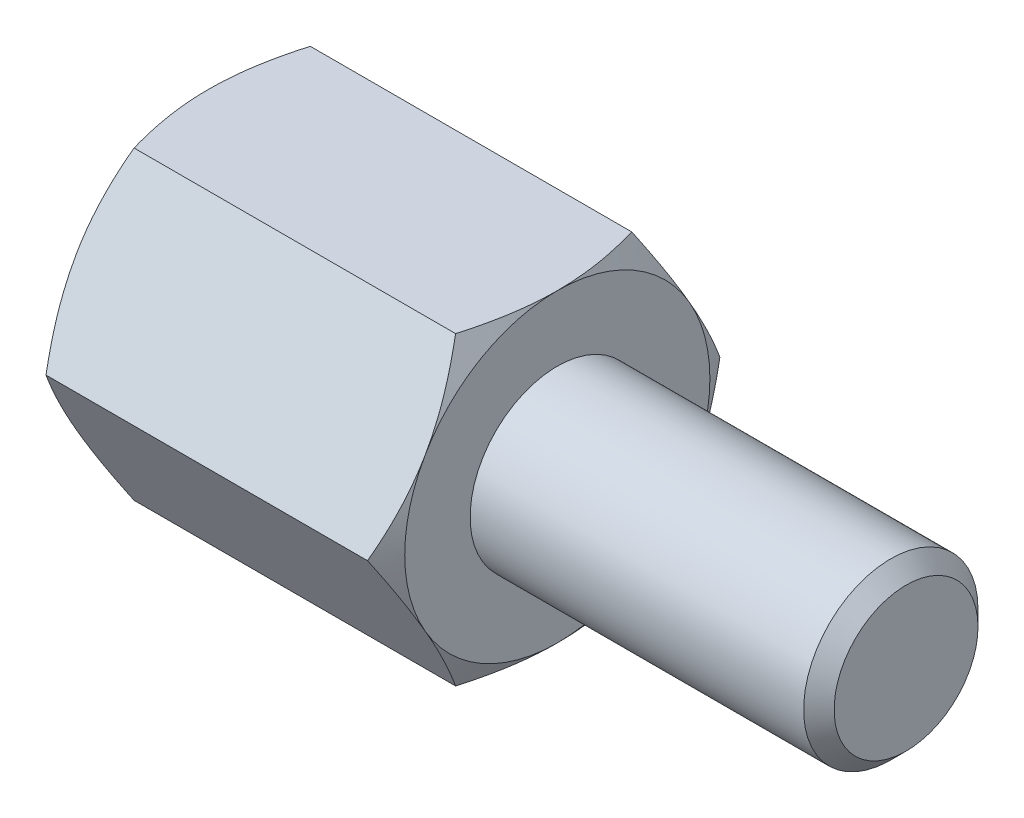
ISO-10303-21;
HEADER;
FILE_DESCRIPTION(('STEP AP214'),'2;1');
FILE_NAME('part.step','',(''),(''),'','','');
FILE_SCHEMA(('AUTOMOTIVE_DESIGN { 1 0 10303 214 1 1 1 1 }'));
ENDSEC;
DATA;
#1=APPLICATION_CONTEXT('core data for automotive mechanical design processes');
#2=APPLICATION_PROTOCOL_DEFINITION('international standard','automotive_design',2000,#1);
#3=PRODUCT_CONTEXT('',#1,'mechanical');
#4=PRODUCT('Part','Part','',(#3));
#5=PRODUCT_RELATED_PRODUCT_CATEGORY('part','',(#4));
#6=PRODUCT_DEFINITION_FORMATION('','',#4);
#7=PRODUCT_DEFINITION_CONTEXT('part definition',#1,'design');
#8=PRODUCT_DEFINITION('design','',#6,#7);
#9=PRODUCT_DEFINITION_SHAPE('','',#8);
#10=(LENGTH_UNIT() NAMED_UNIT(*) SI_UNIT(.MILLI.,.METRE.));
#11=(NAMED_UNIT(*) PLANE_ANGLE_UNIT() SI_UNIT($,.RADIAN.));
#12=(NAMED_UNIT(*) SI_UNIT($,.STERADIAN.) SOLID_ANGLE_UNIT());
#13=UNCERTAINTY_MEASURE_WITH_UNIT(LENGTH_MEASURE(1.E-05),#10,'distance_accuracy_value','');
#14=(GEOMETRIC_REPRESENTATION_CONTEXT(3) GLOBAL_UNCERTAINTY_ASSIGNED_CONTEXT((#13)) GLOBAL_UNIT_ASSIGNED_CONTEXT((#10,
#11,#12)) REPRESENTATION_CONTEXT('',''));
#15=CARTESIAN_POINT('',(0.,0.,0.));
#16=DIRECTION('',(0.,0.,1.));
#17=DIRECTION('',(1.,0.,0.));
#18=AXIS2_PLACEMENT_3D('',#15,#16,#17);
#19=CARTESIAN_POINT('',(4.,3.5,-2.02072594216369));
#20=DIRECTION('',(1.,0.,0.));
#21=DIRECTION('',(0.,0.,-1.));
#22=AXIS2_PLACEMENT_3D('',#19,#20,#21);
#23=PLANE('',#22);
#24=CARTESIAN_POINT('',(4.,0.,0.));
#25=DIRECTION('',(1.,0.,0.));
#26=DIRECTION('',(0.,0.,-1.));
#27=AXIS2_PLACEMENT_3D('',#24,#25,#26);
#28=CIRCLE('',#27,3.5);
#29=CARTESIAN_POINT('',(4.,-1.75,-3.03108891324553));
#30=VERTEX_POINT('',#29);
#31=CARTESIAN_POINT('',(4.,1.75,-3.03108891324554));
#32=VERTEX_POINT('',#31);
#33=EDGE_CURVE('E288',#30,#32,#28,.T.);
#34=ORIENTED_EDGE('',*,*,#33,.T.);
#35=CARTESIAN_POINT('',(4.,3.5,0.));
#36=VERTEX_POINT('',#35);
#37=EDGE_CURVE('E53',#32,#36,#28,.T.);
#38=ORIENTED_EDGE('',*,*,#37,.T.);
#39=CARTESIAN_POINT('',(4.,1.75,3.03108891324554));
#40=VERTEX_POINT('',#39);
#41=EDGE_CURVE('E295',#36,#40,#28,.T.);
#42=ORIENTED_EDGE('',*,*,#41,.T.);
#43=CARTESIAN_POINT('',(4.,-1.75,3.03108891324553));
#44=VERTEX_POINT('',#43);
#45=EDGE_CURVE('E300',#40,#44,#28,.T.);
#46=ORIENTED_EDGE('',*,*,#45,.T.);
#47=CARTESIAN_POINT('',(4.,0.,0.));
#48=DIRECTION('',(-1.,0.,0.));
#49=DIRECTION('',(0.,-1.,0.));
#50=AXIS2_PLACEMENT_3D('',#47,#48,#49);
#51=CIRCLE('',#50,3.5);
#52=CARTESIAN_POINT('',(4.,-3.5,0.));
#53=VERTEX_POINT('',#52);
#54=EDGE_CURVE('E193',#53,#44,#51,.T.);
#55=ORIENTED_EDGE('',*,*,#54,.F.);
#56=EDGE_CURVE('E61',#53,#30,#28,.T.);
#57=ORIENTED_EDGE('',*,*,#56,.T.);
#58=EDGE_LOOP('',(#34,#38,#42,#46,#55,#57));
#59=FACE_BOUND('',#58,.T.);
#60=CARTESIAN_POINT('',(4.,0.,0.));
#61=DIRECTION('',(1.,0.,0.));
#62=DIRECTION('',(0.,0.,-1.));
#63=AXIS2_PLACEMENT_3D('',#60,#61,#62);
#64=CIRCLE('',#63,2.);
#65=CARTESIAN_POINT('',(4.,0.,-2.));
#66=VERTEX_POINT('',#65);
#67=EDGE_CURVE('E311',#66,#66,#64,.T.);
#68=ORIENTED_EDGE('',*,*,#67,.F.);
#69=EDGE_LOOP('',(#68));
#70=FACE_BOUND('',#69,.T.);
#71=ADVANCED_FACE('F37',(#59,#70),#23,.T.);
#72=CARTESIAN_POINT('',(4.,0.,-4.04145188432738));
#73=DIRECTION('',(0.,-0.5,0.866025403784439));
#74=DIRECTION('',(0.,-0.866025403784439,-0.5));
#75=AXIS2_PLACEMENT_3D('',#72,#73,#74);
#76=PLANE('',#75);
#77=CARTESIAN_POINT('',(3.68732593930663,-0.000200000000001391,-4.04156735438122));
#78=CARTESIAN_POINT('',(3.73861421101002,0.153607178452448,-3.9527667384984));
#79=CARTESIAN_POINT('',(3.78525904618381,0.308742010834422,-3.86319960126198));
#80=CARTESIAN_POINT('',(3.86667812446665,0.621698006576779,-3.68251437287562));
#81=CARTESIAN_POINT('',(3.90142356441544,0.779524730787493,-3.59139307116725));
#82=CARTESIAN_POINT('',(3.95550997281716,1.09322221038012,-3.41027974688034));
#83=CARTESIAN_POINT('',(3.97521091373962,1.24904469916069,-3.32031559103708));
#84=CARTESIAN_POINT('',(3.99872986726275,1.56142288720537,-3.13996396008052));
#85=CARTESIAN_POINT('',(4.00256735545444,1.71797745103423,-3.04957714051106));
#86=CARTESIAN_POINT('',(3.99458469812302,2.01050921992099,-2.88068384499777));
#87=CARTESIAN_POINT('',(3.98472456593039,2.1465302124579,-2.80215208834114));
#88=CARTESIAN_POINT('',(3.9534735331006,2.41768602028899,-2.64560020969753));
#89=CARTESIAN_POINT('',(3.9320719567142,2.55281989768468,-2.5675806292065));
#90=CARTESIAN_POINT('',(3.87856959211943,2.82453479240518,-2.41070596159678));
#91=CARTESIAN_POINT('',(3.84624200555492,2.96108141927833,-2.33187072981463));
#92=CARTESIAN_POINT('',(3.77287106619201,3.2321380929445,-2.17537608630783));
#93=CARTESIAN_POINT('',(3.73184495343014,3.36665161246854,-2.09771466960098));
#94=CARTESIAN_POINT('',(3.68732593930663,3.5002,-2.02061047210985));
#95=B_SPLINE_CURVE_WITH_KNOTS('',3,(#77,#78,#79,#80,#81,#82,#83,#84,#85,#86,#87,#88,#89,#90,#91,
#92,#93,#94),.UNSPECIFIED.,.F.,.F.,(4,2,2,2,2,2,2,2,4),(0.,0.554793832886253,1.11092123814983,
1.65328467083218,2.19498204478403,2.6666513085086,3.13875761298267,3.62133612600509,
4.10296698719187),.UNSPECIFIED.);
#96=CARTESIAN_POINT('',(3.68739260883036,0.,-4.04145188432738));
#97=VERTEX_POINT('',#96);
#98=EDGE_CURVE('E310',#97,#32,#95,.T.);
#99=ORIENTED_EDGE('',*,*,#98,.F.);
#100=DIRECTION('',(-1.,0.,0.));
#101=VECTOR('',#100,1.);
#102=CARTESIAN_POINT('',(4.,0.,-4.04145188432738));
#103=LINE('',#102,#101);
#104=CARTESIAN_POINT('',(-3.68739260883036,0.,-4.04145188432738));
#105=VERTEX_POINT('',#104);
#106=EDGE_CURVE('E264',#97,#105,#103,.T.);
#107=ORIENTED_EDGE('',*,*,#106,.T.);
#108=CARTESIAN_POINT('',(-3.68732593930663,3.5002,-2.02061047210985));
#109=CARTESIAN_POINT('',(-3.73861421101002,3.34639282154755,-2.10941108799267));
#110=CARTESIAN_POINT('',(-3.78525904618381,3.19125798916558,-2.19897822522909));
#111=CARTESIAN_POINT('',(-3.86667812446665,2.87830199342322,-2.37966345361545));
#112=CARTESIAN_POINT('',(-3.90142356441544,2.7204752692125,-2.47078475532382));
#113=CARTESIAN_POINT('',(-3.95550997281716,2.40677778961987,-2.65189807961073));
#114=CARTESIAN_POINT('',(-3.97521091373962,2.25095530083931,-2.74186223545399));
#115=CARTESIAN_POINT('',(-3.99872986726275,1.93857711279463,-2.92221386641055));
#116=CARTESIAN_POINT('',(-4.00256735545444,1.78202254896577,-3.01260068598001));
#117=CARTESIAN_POINT('',(-3.99458469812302,1.48949078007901,-3.18149398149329));
#118=CARTESIAN_POINT('',(-3.98472456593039,1.3534697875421,-3.26002573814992));
#119=CARTESIAN_POINT('',(-3.9534735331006,1.08231397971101,-3.41657761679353));
#120=CARTESIAN_POINT('',(-3.9320719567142,0.947180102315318,-3.49459719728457));
#121=CARTESIAN_POINT('',(-3.87856959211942,0.675465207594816,-3.65147186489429));
#122=CARTESIAN_POINT('',(-3.84624200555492,0.538918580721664,-3.73030709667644));
#123=CARTESIAN_POINT('',(-3.77287106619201,0.267861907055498,-3.88680174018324));
#124=CARTESIAN_POINT('',(-3.73184495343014,0.133348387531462,-3.96446315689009));
#125=CARTESIAN_POINT('',(-3.68732593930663,-0.000200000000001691,-4.04156735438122));
#126=B_SPLINE_CURVE_WITH_KNOTS('',3,(#108,#109,#110,#111,#112,#113,#114,#115,#116,#117,#118,
#119,#120,#121,#122,#123,#124,#125),.UNSPECIFIED.,.F.,.F.,(4,2,2,2,2,2,2,2,4),(0.,
0.554793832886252,1.11092123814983,1.65328467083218,2.19498204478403,2.6666513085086,
3.13875761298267,3.6213361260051,4.10296698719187),.UNSPECIFIED.);
#127=CARTESIAN_POINT('',(-4.,1.75,-3.03108891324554));
#128=VERTEX_POINT('',#127);
#129=EDGE_CURVE('E376',#128,#105,#126,.T.);
#130=ORIENTED_EDGE('',*,*,#129,.F.);
#131=CARTESIAN_POINT('',(-3.68739260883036,3.5,-2.02072594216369));
#132=VERTEX_POINT('',#131);
#133=EDGE_CURVE('E378',#132,#128,#126,.T.);
#134=ORIENTED_EDGE('',*,*,#133,.F.);
#135=DIRECTION('',(-1.,0.,0.));
#136=VECTOR('',#135,1.);
#137=CARTESIAN_POINT('',(4.,3.5,-2.02072594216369));
#138=LINE('',#137,#136);
#139=CARTESIAN_POINT('',(3.68739260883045,3.5,-2.02072594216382));
#140=VERTEX_POINT('',#139);
#141=EDGE_CURVE('E279',#140,#132,#138,.T.);
#142=ORIENTED_EDGE('',*,*,#141,.F.);
#143=EDGE_CURVE('E229',#32,#140,#95,.T.);
#144=ORIENTED_EDGE('',*,*,#143,.F.);
#145=EDGE_LOOP('',(#99,#107,#130,#134,#142,#144));
#146=FACE_BOUND('',#145,.T.);
#147=ADVANCED_FACE('F148',(#146),#76,.F.);
#148=CARTESIAN_POINT('',(4.,3.5,-2.02072594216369));
#149=DIRECTION('',(0.,-1.,0.));
#150=DIRECTION('',(0.,0.,-1.));
#151=AXIS2_PLACEMENT_3D('',#148,#149,#150);
#152=PLANE('',#151);
#153=CARTESIAN_POINT('',(2.24432944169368,3.5,-5.52571367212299));
#154=CARTESIAN_POINT('',(2.3192813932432,3.5,-5.37200190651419));
#155=CARTESIAN_POINT('',(2.39354243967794,3.5,-5.21794762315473));
#156=CARTESIAN_POINT('',(2.54029601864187,3.5,-4.90897223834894));
#157=CARTESIAN_POINT('',(2.61278829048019,3.5,-4.75405101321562));
#158=CARTESIAN_POINT('',(2.75596172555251,3.5,-4.44240758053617));
#159=CARTESIAN_POINT('',(2.82663168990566,3.5,-4.28568021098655));
#160=CARTESIAN_POINT('',(2.96520746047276,3.5,-3.97101270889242));
#161=CARTESIAN_POINT('',(3.03311339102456,3.5,-3.81307263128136));
#162=CARTESIAN_POINT('',(3.16771439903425,3.5,-3.49026114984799));
#163=CARTESIAN_POINT('',(3.23428710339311,3.5,-3.32533845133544));
#164=CARTESIAN_POINT('',(3.36262677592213,3.5,-2.99359992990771));
#165=CARTESIAN_POINT('',(3.42439321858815,3.5,-2.82678390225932));
#166=CARTESIAN_POINT('',(3.54157006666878,3.5,-2.49127529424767));
#167=CARTESIAN_POINT('',(3.59699254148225,3.5,-2.32258697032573));
#168=CARTESIAN_POINT('',(3.69976794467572,3.5,-1.98279215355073));
#169=CARTESIAN_POINT('',(3.74712331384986,3.5,-1.81168640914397));
#170=CARTESIAN_POINT('',(3.83129873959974,3.5,-1.46793354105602));
#171=CARTESIAN_POINT('',(3.86817965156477,3.5,-1.2953015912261));
#172=CARTESIAN_POINT('',(3.92939557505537,3.5,-0.947791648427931));
#173=CARTESIAN_POINT('',(3.953731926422,3.5,-0.77291389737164));
#174=CARTESIAN_POINT('',(3.9876038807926,3.5,-0.424108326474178));
#175=CARTESIAN_POINT('',(3.99733725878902,3.5,-0.250200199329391));
#176=CARTESIAN_POINT('',(4.00170533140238,3.5,0.0978233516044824));
#177=CARTESIAN_POINT('',(3.99633996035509,3.5,0.27193877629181));
#178=CARTESIAN_POINT('',(3.97501181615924,3.5,0.564711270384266));
#179=CARTESIAN_POINT('',(3.96289198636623,3.5,0.683667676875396));
#180=CARTESIAN_POINT('',(3.93230809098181,3.5,0.920767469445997));
#181=CARTESIAN_POINT('',(3.91384324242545,3.5,1.03891075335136));
#182=CARTESIAN_POINT('',(3.84989562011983,3.5,1.39193174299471));
#183=CARTESIAN_POINT('',(3.79586958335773,3.5,1.62528232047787));
#184=CARTESIAN_POINT('',(3.70145152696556,3.5,1.97433825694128));
#185=CARTESIAN_POINT('',(3.66729009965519,3.5,2.09183268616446));
#186=CARTESIAN_POINT('',(3.59523444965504,3.5,2.32568238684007));
#187=CARTESIAN_POINT('',(3.55734019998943,3.5,2.44203765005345));
#188=CARTESIAN_POINT('',(3.47844216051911,3.5,2.67364238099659));
#189=CARTESIAN_POINT('',(3.43743925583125,3.5,2.78889215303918));
#190=CARTESIAN_POINT('',(3.35282457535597,3.5,3.01842460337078));
#191=CARTESIAN_POINT('',(3.30921284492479,3.5,3.13270729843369));
#192=CARTESIAN_POINT('',(3.19582414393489,3.5,3.42150510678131));
#193=CARTESIAN_POINT('',(3.12456360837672,3.5,3.59543696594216));
#194=CARTESIAN_POINT('',(2.97810267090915,3.5,3.94163961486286));
#195=CARTESIAN_POINT('',(2.90290192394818,3.5,4.11391025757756));
#196=CARTESIAN_POINT('',(2.74942525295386,3.5,4.45713072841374));
#197=CARTESIAN_POINT('',(2.67114846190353,3.5,4.62808016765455));
#198=CARTESIAN_POINT('',(2.51218826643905,3.5,4.9688584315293));
#199=CARTESIAN_POINT('',(2.43150479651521,3.5,5.13868722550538));
#200=CARTESIAN_POINT('',(2.18638713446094,3.5,5.64726192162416));
#201=CARTESIAN_POINT('',(2.0190975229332,3.5,5.98463020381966));
#202=CARTESIAN_POINT('',(1.67958549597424,3.5,6.65678495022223));
#203=CARTESIAN_POINT('',(1.50736391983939,3.5,6.99157184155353));
#204=CARTESIAN_POINT('',(1.17608002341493,3.5,7.62749570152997));
#205=CARTESIAN_POINT('',(1.01732992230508,3.5,7.92879562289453));
#206=CARTESIAN_POINT('',(0.697747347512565,3.5,8.53030635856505));
#207=CARTESIAN_POINT('',(0.536914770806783,3.5,8.83051711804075));
#208=CARTESIAN_POINT('',(0.214179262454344,3.5,9.42918006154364));
#209=CARTESIAN_POINT('',(0.0522810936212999,3.5,9.72763481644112));
#210=CARTESIAN_POINT('',(-0.272726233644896,3.5,10.3238577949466));
#211=CARTESIAN_POINT('',(-0.435835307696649,3.5,10.6216260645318));
#212=CARTESIAN_POINT('',(-0.599389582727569,3.5,10.9191478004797));
#213=B_SPLINE_CURVE_WITH_KNOTS('',3,(#153,#154,#155,#156,#157,#158,#159,#160,#161,#162,#163,
#164,#165,#166,#167,#168,#169,#170,#171,#172,#173,#174,#175,#176,#177,#178,#179,#180,#181,#182,
#183,#184,#185,#186,#187,#188,#189,#190,#191,#192,#193,#194,#195,#196,#197,#198,#199,#200,#201,
#202,#203,#204,#205,#206,#207,#208,#209,#210,#211,#212),.UNSPECIFIED.,.F.,.F.,(4,2,2,2,2,2,2,2,
2,2,2,2,2,2,2,2,2,2,2,2,2,2,2,2,2,2,2,2,2,4),(0.,0.513041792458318,1.02615874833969,
1.54190801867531,2.05763406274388,2.59113284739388,3.1246898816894,3.65721433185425,
4.18957737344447,4.71878103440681,5.24792816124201,5.76984197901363,6.29175806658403,
6.65030258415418,7.0088913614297,7.72642330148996,8.09346920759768,8.46051776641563,
8.8274622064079,9.19440026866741,9.75822236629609,10.3220939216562,10.8861255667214,
11.4501725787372,12.579801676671,13.7092396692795,14.730918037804,15.7526471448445,
16.7712589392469,17.7898004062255),.UNSPECIFIED.);
#214=EDGE_CURVE('E227',#140,#36,#213,.T.);
#215=ORIENTED_EDGE('',*,*,#214,.F.);
#216=ORIENTED_EDGE('',*,*,#141,.T.);
#217=CARTESIAN_POINT('',(-2.24432944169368,3.5,-5.52571367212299));
#218=CARTESIAN_POINT('',(-2.3192813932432,3.5,-5.37200190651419));
#219=CARTESIAN_POINT('',(-2.39354243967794,3.5,-5.21794762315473));
#220=CARTESIAN_POINT('',(-2.54029601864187,3.5,-4.90897223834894));
#221=CARTESIAN_POINT('',(-2.61278829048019,3.5,-4.75405101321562));
#222=CARTESIAN_POINT('',(-2.75596172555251,3.5,-4.44240758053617));
#223=CARTESIAN_POINT('',(-2.82663168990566,3.5,-4.28568021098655));
#224=CARTESIAN_POINT('',(-2.96520746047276,3.5,-3.97101270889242));
#225=CARTESIAN_POINT('',(-3.03311339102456,3.5,-3.81307263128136));
#226=CARTESIAN_POINT('',(-3.16771439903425,3.5,-3.49026114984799));
#227=CARTESIAN_POINT('',(-3.23428710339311,3.5,-3.32533845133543));
#228=CARTESIAN_POINT('',(-3.36262677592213,3.5,-2.99359992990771));
#229=CARTESIAN_POINT('',(-3.42439321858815,3.5,-2.82678390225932));
#230=CARTESIAN_POINT('',(-3.54157006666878,3.5,-2.49127529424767));
#231=CARTESIAN_POINT('',(-3.59699254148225,3.5,-2.32258697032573));
#232=CARTESIAN_POINT('',(-3.69976794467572,3.5,-1.98279215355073));
#233=CARTESIAN_POINT('',(-3.74712331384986,3.5,-1.81168640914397));
#234=CARTESIAN_POINT('',(-3.83129873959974,3.5,-1.46793354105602));
#235=CARTESIAN_POINT('',(-3.86817965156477,3.5,-1.2953015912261));
#236=CARTESIAN_POINT('',(-3.92939557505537,3.5,-0.947791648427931));
#237=CARTESIAN_POINT('',(-3.953731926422,3.5,-0.77291389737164));
#238=CARTESIAN_POINT('',(-3.9876038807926,3.5,-0.424108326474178));
#239=CARTESIAN_POINT('',(-3.99733725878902,3.5,-0.25020019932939));
#240=CARTESIAN_POINT('',(-4.00170533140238,3.5,0.0978233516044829));
#241=CARTESIAN_POINT('',(-3.99633996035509,3.5,0.271938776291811));
#242=CARTESIAN_POINT('',(-3.97501181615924,3.5,0.564711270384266));
#243=CARTESIAN_POINT('',(-3.96289198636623,3.5,0.683667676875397));
#244=CARTESIAN_POINT('',(-3.93230809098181,3.5,0.920767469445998));
#245=CARTESIAN_POINT('',(-3.91384324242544,3.5,1.03891075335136));
#246=CARTESIAN_POINT('',(-3.84989562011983,3.5,1.39193174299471));
#247=CARTESIAN_POINT('',(-3.79586958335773,3.5,1.62528232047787));
#248=CARTESIAN_POINT('',(-3.70145152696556,3.5,1.97433825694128));
#249=CARTESIAN_POINT('',(-3.66729009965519,3.5,2.09183268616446));
#250=CARTESIAN_POINT('',(-3.59523444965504,3.5,2.32568238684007));
#251=CARTESIAN_POINT('',(-3.55734019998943,3.5,2.44203765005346));
#252=CARTESIAN_POINT('',(-3.47844216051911,3.5,2.67364238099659));
#253=CARTESIAN_POINT('',(-3.43743925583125,3.5,2.78889215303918));
#254=CARTESIAN_POINT('',(-3.35282457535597,3.5,3.01842460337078));
#255=CARTESIAN_POINT('',(-3.30921284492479,3.5,3.13270729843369));
#256=CARTESIAN_POINT('',(-3.19582414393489,3.5,3.42150510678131));
#257=CARTESIAN_POINT('',(-3.12456360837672,3.5,3.59543696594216));
#258=CARTESIAN_POINT('',(-2.97810267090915,3.5,3.94163961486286));
#259=CARTESIAN_POINT('',(-2.90290192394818,3.5,4.11391025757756));
#260=CARTESIAN_POINT('',(-2.74942525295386,3.5,4.45713072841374));
#261=CARTESIAN_POINT('',(-2.67114846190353,3.5,4.62808016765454));
#262=CARTESIAN_POINT('',(-2.51218826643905,3.5,4.96885843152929));
#263=CARTESIAN_POINT('',(-2.43150479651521,3.5,5.13868722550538));
#264=CARTESIAN_POINT('',(-2.18638713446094,3.5,5.64726192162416));
#265=CARTESIAN_POINT('',(-2.0190975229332,3.5,5.98463020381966));
#266=CARTESIAN_POINT('',(-1.67958549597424,3.5,6.65678495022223));
#267=CARTESIAN_POINT('',(-1.5073639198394,3.5,6.99157184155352));
#268=CARTESIAN_POINT('',(-1.17608002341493,3.5,7.62749570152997));
#269=CARTESIAN_POINT('',(-1.01732992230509,3.5,7.92879562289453));
#270=CARTESIAN_POINT('',(-0.697747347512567,3.5,8.53030635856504));
#271=CARTESIAN_POINT('',(-0.536914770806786,3.5,8.83051711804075));
#272=CARTESIAN_POINT('',(-0.214179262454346,3.5,9.42918006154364));
#273=CARTESIAN_POINT('',(-0.0522810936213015,3.5,9.72763481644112));
#274=CARTESIAN_POINT('',(0.272726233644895,3.5,10.3238577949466));
#275=CARTESIAN_POINT('',(0.435835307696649,3.5,10.6216260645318));
#276=CARTESIAN_POINT('',(0.599389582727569,3.5,10.9191478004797));
#277=B_SPLINE_CURVE_WITH_KNOTS('',3,(#217,#218,#219,#220,#221,#222,#223,#224,#225,#226,#227,
#228,#229,#230,#231,#232,#233,#234,#235,#236,#237,#238,#239,#240,#241,#242,#243,#244,#245,#246,
#247,#248,#249,#250,#251,#252,#253,#254,#255,#256,#257,#258,#259,#260,#261,#262,#263,#264,#265,
#266,#267,#268,#269,#270,#271,#272,#273,#274,#275,#276),.UNSPECIFIED.,.F.,.F.,(4,2,2,2,2,2,2,2,
2,2,2,2,2,2,2,2,2,2,2,2,2,2,2,2,2,2,2,2,2,4),(0.,0.513041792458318,1.02615874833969,
1.54190801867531,2.05763406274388,2.59113284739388,3.1246898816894,3.65721433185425,
4.18957737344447,4.71878103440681,5.24792816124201,5.76984197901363,6.29175806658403,
6.65030258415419,7.0088913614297,7.72642330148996,8.09346920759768,8.46051776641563,
8.8274622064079,9.19440026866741,9.75822236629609,10.3220939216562,10.8861255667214,
11.4501725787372,12.579801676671,13.7092396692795,14.730918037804,15.7526471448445,
16.7712589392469,17.7898004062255),.UNSPECIFIED.);
#278=CARTESIAN_POINT('',(-4.,3.5,0.));
#279=VERTEX_POINT('',#278);
#280=EDGE_CURVE('E241',#279,#132,#277,.F.);
#281=ORIENTED_EDGE('',*,*,#280,.F.);
#282=CARTESIAN_POINT('',(-3.68739260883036,3.5,2.02072594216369));
#283=VERTEX_POINT('',#282);
#284=EDGE_CURVE('E249',#283,#279,#277,.F.);
#285=ORIENTED_EDGE('',*,*,#284,.F.);
#286=DIRECTION('',(-1.,0.,0.));
#287=VECTOR('',#286,1.);
#288=CARTESIAN_POINT('',(4.,3.5,2.02072594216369));
#289=LINE('',#288,#287);
#290=CARTESIAN_POINT('',(3.68739260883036,3.5,2.02072594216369));
#291=VERTEX_POINT('',#290);
#292=EDGE_CURVE('E276',#291,#283,#289,.T.);
#293=ORIENTED_EDGE('',*,*,#292,.F.);
#294=EDGE_CURVE('E221',#36,#291,#213,.T.);
#295=ORIENTED_EDGE('',*,*,#294,.F.);
#296=EDGE_LOOP('',(#215,#216,#281,#285,#293,#295));
#297=FACE_BOUND('',#296,.T.);
#298=ADVANCED_FACE('F153',(#297),#152,.F.);
#299=CARTESIAN_POINT('',(4.,3.5,2.02072594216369));
#300=DIRECTION('',(0.,-0.5,-0.866025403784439));
#301=DIRECTION('',(0.,0.866025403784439,-0.5));
#302=AXIS2_PLACEMENT_3D('',#299,#300,#301);
#303=PLANE('',#302);
#304=CARTESIAN_POINT('',(3.68732593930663,3.5002,2.02061047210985));
#305=CARTESIAN_POINT('',(3.73861421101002,3.34639282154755,2.10941108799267));
#306=CARTESIAN_POINT('',(3.78525904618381,3.19125798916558,2.19897822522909));
#307=CARTESIAN_POINT('',(3.86667812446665,2.87830199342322,2.37966345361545));
#308=CARTESIAN_POINT('',(3.90142356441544,2.7204752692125,2.47078475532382));
#309=CARTESIAN_POINT('',(3.95550997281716,2.40677778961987,2.65189807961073));
#310=CARTESIAN_POINT('',(3.97521091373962,2.25095530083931,2.74186223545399));
#311=CARTESIAN_POINT('',(3.99872986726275,1.93857711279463,2.92221386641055));
#312=CARTESIAN_POINT('',(4.00256735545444,1.78202254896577,3.01260068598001));
#313=CARTESIAN_POINT('',(3.99458469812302,1.48949078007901,3.1814939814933));
#314=CARTESIAN_POINT('',(3.98472456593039,1.35346978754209,3.26002573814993));
#315=CARTESIAN_POINT('',(3.9534735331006,1.08231397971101,3.41657761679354));
#316=CARTESIAN_POINT('',(3.9320719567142,0.947180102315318,3.49459719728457));
#317=CARTESIAN_POINT('',(3.87856959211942,0.675465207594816,3.65147186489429));
#318=CARTESIAN_POINT('',(3.84624200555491,0.538918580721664,3.73030709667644));
#319=CARTESIAN_POINT('',(3.77287106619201,0.267861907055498,3.88680174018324));
#320=CARTESIAN_POINT('',(3.73184495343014,0.133348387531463,3.96446315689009));
#321=CARTESIAN_POINT('',(3.68732593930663,-0.000200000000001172,4.04156735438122));
#322=B_SPLINE_CURVE_WITH_KNOTS('',3,(#304,#305,#306,#307,#308,#309,#310,#311,#312,#313,#314,
#315,#316,#317,#318,#319,#320,#321),.UNSPECIFIED.,.F.,.F.,(4,2,2,2,2,2,2,2,4),(0.,
0.554793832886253,1.11092123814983,1.65328467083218,2.19498204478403,2.6666513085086,
3.13875761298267,3.62133612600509,4.10296698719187),.UNSPECIFIED.);
#323=EDGE_CURVE('E228',#291,#40,#322,.T.);
#324=ORIENTED_EDGE('',*,*,#323,.F.);
#325=ORIENTED_EDGE('',*,*,#292,.T.);
#326=CARTESIAN_POINT('',(-3.68732593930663,-0.000200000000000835,4.04156735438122));
#327=CARTESIAN_POINT('',(-3.73861421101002,0.153607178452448,3.9527667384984));
#328=CARTESIAN_POINT('',(-3.78525904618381,0.308742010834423,3.86319960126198));
#329=CARTESIAN_POINT('',(-3.86667812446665,0.62169800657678,3.68251437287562));
#330=CARTESIAN_POINT('',(-3.90142356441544,0.779524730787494,3.59139307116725));
#331=CARTESIAN_POINT('',(-3.95550997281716,1.09322221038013,3.41027974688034));
#332=CARTESIAN_POINT('',(-3.97521091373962,1.24904469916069,3.32031559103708));
#333=CARTESIAN_POINT('',(-3.99872986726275,1.56142288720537,3.13996396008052));
#334=CARTESIAN_POINT('',(-4.00256735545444,1.71797745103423,3.04957714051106));
#335=CARTESIAN_POINT('',(-3.99458469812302,2.01050921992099,2.88068384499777));
#336=CARTESIAN_POINT('',(-3.98472456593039,2.1465302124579,2.80215208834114));
#337=CARTESIAN_POINT('',(-3.9534735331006,2.41768602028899,2.64560020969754));
#338=CARTESIAN_POINT('',(-3.9320719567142,2.55281989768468,2.5675806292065));
#339=CARTESIAN_POINT('',(-3.87856959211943,2.82453479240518,2.41070596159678));
#340=CARTESIAN_POINT('',(-3.84624200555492,2.96108141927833,2.33187072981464));
#341=CARTESIAN_POINT('',(-3.77287106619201,3.2321380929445,2.17537608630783));
#342=CARTESIAN_POINT('',(-3.73184495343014,3.36665161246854,2.09771466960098));
#343=CARTESIAN_POINT('',(-3.68732593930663,3.5002,2.02061047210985));
#344=B_SPLINE_CURVE_WITH_KNOTS('',3,(#326,#327,#328,#329,#330,#331,#332,#333,#334,#335,#336,
#337,#338,#339,#340,#341,#342,#343),.UNSPECIFIED.,.F.,.F.,(4,2,2,2,2,2,2,2,4),(0.,
0.554793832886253,1.11092123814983,1.65328467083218,2.19498204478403,2.6666513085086,
3.13875761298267,3.62133612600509,4.10296698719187),.UNSPECIFIED.);
#345=CARTESIAN_POINT('',(-4.,1.75,3.03108891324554));
#346=VERTEX_POINT('',#345);
#347=EDGE_CURVE('E255',#346,#283,#344,.T.);
#348=ORIENTED_EDGE('',*,*,#347,.F.);
#349=CARTESIAN_POINT('',(-3.68739260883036,0.,4.04145188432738));
#350=VERTEX_POINT('',#349);
#351=EDGE_CURVE('E262',#350,#346,#344,.T.);
#352=ORIENTED_EDGE('',*,*,#351,.F.);
#353=DIRECTION('',(-1.,0.,0.));
#354=VECTOR('',#353,1.);
#355=CARTESIAN_POINT('',(4.,0.,4.04145188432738));
#356=LINE('',#355,#354);
#357=CARTESIAN_POINT('',(3.68739260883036,0.,4.04145188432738));
#358=VERTEX_POINT('',#357);
#359=EDGE_CURVE('E273',#358,#350,#356,.T.);
#360=ORIENTED_EDGE('',*,*,#359,.F.);
#361=EDGE_CURVE('E215',#40,#358,#322,.T.);
#362=ORIENTED_EDGE('',*,*,#361,.F.);
#363=EDGE_LOOP('',(#324,#325,#348,#352,#360,#362));
#364=FACE_BOUND('',#363,.T.);
#365=ADVANCED_FACE('F235',(#364),#303,.F.);
#366=CARTESIAN_POINT('',(4.,0.,4.04145188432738));
#367=DIRECTION('',(0.,0.5,-0.866025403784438));
#368=DIRECTION('',(0.,0.866025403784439,0.5));
#369=AXIS2_PLACEMENT_3D('',#366,#367,#368);
#370=PLANE('',#369);
#371=CARTESIAN_POINT('',(3.68732593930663,0.000199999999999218,4.04156735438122));
#372=CARTESIAN_POINT('',(3.73861421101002,-0.15360717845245,3.9527667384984));
#373=CARTESIAN_POINT('',(3.78525904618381,-0.308742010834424,3.86319960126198));
#374=CARTESIAN_POINT('',(3.86667812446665,-0.621698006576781,3.68251437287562));
#375=CARTESIAN_POINT('',(3.90142356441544,-0.779524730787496,3.59139307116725));
#376=CARTESIAN_POINT('',(3.95550997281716,-1.09322221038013,3.41027974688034));
#377=CARTESIAN_POINT('',(3.97521091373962,-1.24904469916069,3.32031559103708));
#378=CARTESIAN_POINT('',(3.99872986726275,-1.56142288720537,3.13996396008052));
#379=CARTESIAN_POINT('',(4.00256735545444,-1.71797745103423,3.04957714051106));
#380=CARTESIAN_POINT('',(3.99458469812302,-2.01050921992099,2.88068384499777));
#381=CARTESIAN_POINT('',(3.98472456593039,-2.1465302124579,2.80215208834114));
#382=CARTESIAN_POINT('',(3.9534735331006,-2.41768602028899,2.64560020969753));
#383=CARTESIAN_POINT('',(3.9320719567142,-2.55281989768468,2.5675806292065));
#384=CARTESIAN_POINT('',(3.87856959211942,-2.82453479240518,2.41070596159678));
#385=CARTESIAN_POINT('',(3.84624200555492,-2.96108141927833,2.33187072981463));
#386=CARTESIAN_POINT('',(3.77287106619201,-3.2321380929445,2.17537608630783));
#387=CARTESIAN_POINT('',(3.73184495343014,-3.36665161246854,2.09771466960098));
#388=CARTESIAN_POINT('',(3.68732593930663,-3.5002,2.02061047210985));
#389=B_SPLINE_CURVE_WITH_KNOTS('',3,(#371,#372,#373,#374,#375,#376,#377,#378,#379,#380,#381,
#382,#383,#384,#385,#386,#387,#388),.UNSPECIFIED.,.F.,.F.,(4,2,2,2,2,2,2,2,4),(0.,
0.554793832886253,1.11092123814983,1.65328467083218,2.19498204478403,2.6666513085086,
3.13875761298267,3.62133612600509,4.10296698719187),.UNSPECIFIED.);
#390=EDGE_CURVE('E435',#358,#44,#389,.T.);
#391=ORIENTED_EDGE('',*,*,#390,.F.);
#392=ORIENTED_EDGE('',*,*,#359,.T.);
#393=CARTESIAN_POINT('',(-3.68732593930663,-3.5002,2.02061047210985));
#394=CARTESIAN_POINT('',(-3.73861421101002,-3.34639282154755,2.10941108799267));
#395=CARTESIAN_POINT('',(-3.78525904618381,-3.19125798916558,2.19897822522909));
#396=CARTESIAN_POINT('',(-3.86667812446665,-2.87830199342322,2.37966345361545));
#397=CARTESIAN_POINT('',(-3.90142356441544,-2.72047526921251,2.47078475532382));
#398=CARTESIAN_POINT('',(-3.95550997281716,-2.40677778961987,2.65189807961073));
#399=CARTESIAN_POINT('',(-3.97521091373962,-2.25095530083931,2.74186223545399));
#400=CARTESIAN_POINT('',(-3.99872986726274,-1.93857711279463,2.92221386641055));
#401=CARTESIAN_POINT('',(-4.00256735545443,-1.78202254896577,3.01260068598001));
#402=CARTESIAN_POINT('',(-3.99458469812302,-1.48949078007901,3.1814939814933));
#403=CARTESIAN_POINT('',(-3.98472456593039,-1.3534697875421,3.26002573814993));
#404=CARTESIAN_POINT('',(-3.9534735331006,-1.08231397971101,3.41657761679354));
#405=CARTESIAN_POINT('',(-3.9320719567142,-0.947180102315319,3.49459719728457));
#406=CARTESIAN_POINT('',(-3.87856959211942,-0.675465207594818,3.65147186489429));
#407=CARTESIAN_POINT('',(-3.84624200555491,-0.538918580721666,3.73030709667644));
#408=CARTESIAN_POINT('',(-3.77287106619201,-0.2678619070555,3.88680174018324));
#409=CARTESIAN_POINT('',(-3.73184495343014,-0.133348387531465,3.96446315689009));
#410=CARTESIAN_POINT('',(-3.68732593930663,0.00019999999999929,4.04156735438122));
#411=B_SPLINE_CURVE_WITH_KNOTS('',3,(#393,#394,#395,#396,#397,#398,#399,#400,#401,#402,#403,
#404,#405,#406,#407,#408,#409,#410),.UNSPECIFIED.,.F.,.F.,(4,2,2,2,2,2,2,2,4),(0.,
0.554793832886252,1.11092123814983,1.65328467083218,2.19498204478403,2.6666513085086,
3.13875761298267,3.62133612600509,4.10296698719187),.UNSPECIFIED.);
#412=CARTESIAN_POINT('',(-4.,-1.75,3.03108891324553));
#413=VERTEX_POINT('',#412);
#414=EDGE_CURVE('E263',#413,#350,#411,.T.);
#415=ORIENTED_EDGE('',*,*,#414,.F.);
#416=CARTESIAN_POINT('',(-3.68739260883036,-3.5,2.02072594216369));
#417=VERTEX_POINT('',#416);
#418=EDGE_CURVE('E250',#417,#413,#411,.T.);
#419=ORIENTED_EDGE('',*,*,#418,.F.);
#420=DIRECTION('',(-1.,0.,0.));
#421=VECTOR('',#420,1.);
#422=CARTESIAN_POINT('',(4.,-3.5,2.02072594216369));
#423=LINE('',#422,#421);
#424=CARTESIAN_POINT('',(3.68739260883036,-3.5,2.02072594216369));
#425=VERTEX_POINT('',#424);
#426=EDGE_CURVE('E270',#425,#417,#423,.T.);
#427=ORIENTED_EDGE('',*,*,#426,.F.);
#428=EDGE_CURVE('E210',#44,#425,#389,.T.);
#429=ORIENTED_EDGE('',*,*,#428,.F.);
#430=EDGE_LOOP('',(#391,#392,#415,#419,#427,#429));
#431=FACE_BOUND('',#430,.T.);
#432=ADVANCED_FACE('F412',(#431),#370,.F.);
#433=CARTESIAN_POINT('',(4.,-3.5,2.02072594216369));
#434=DIRECTION('',(0.,1.,0.));
#435=DIRECTION('',(0.,0.,1.));
#436=AXIS2_PLACEMENT_3D('',#433,#434,#435);
#437=PLANE('',#436);
#438=CARTESIAN_POINT('',(2.24432944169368,-3.5,-5.525713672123));
#439=CARTESIAN_POINT('',(2.3192813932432,-3.5,-5.37200190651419));
#440=CARTESIAN_POINT('',(2.39354243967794,-3.5,-5.21794762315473));
#441=CARTESIAN_POINT('',(2.54029601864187,-3.5,-4.90897223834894));
#442=CARTESIAN_POINT('',(2.61278829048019,-3.5,-4.75405101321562));
#443=CARTESIAN_POINT('',(2.75596172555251,-3.5,-4.44240758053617));
#444=CARTESIAN_POINT('',(2.82663168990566,-3.5,-4.28568021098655));
#445=CARTESIAN_POINT('',(2.96520746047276,-3.5,-3.97101270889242));
#446=CARTESIAN_POINT('',(3.03311339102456,-3.5,-3.81307263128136));
#447=CARTESIAN_POINT('',(3.16771439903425,-3.5,-3.49026114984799));
#448=CARTESIAN_POINT('',(3.2342871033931,-3.5,-3.32533845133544));
#449=CARTESIAN_POINT('',(3.36262677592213,-3.5,-2.99359992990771));
#450=CARTESIAN_POINT('',(3.42439321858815,-3.5,-2.82678390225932));
#451=CARTESIAN_POINT('',(3.54157006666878,-3.5,-2.49127529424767));
#452=CARTESIAN_POINT('',(3.59699254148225,-3.5,-2.32258697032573));
#453=CARTESIAN_POINT('',(3.69976794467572,-3.5,-1.98279215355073));
#454=CARTESIAN_POINT('',(3.74712331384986,-3.5,-1.81168640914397));
#455=CARTESIAN_POINT('',(3.83129873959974,-3.5,-1.46793354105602));
#456=CARTESIAN_POINT('',(3.86817965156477,-3.5,-1.2953015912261));
#457=CARTESIAN_POINT('',(3.92939557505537,-3.5,-0.947791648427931));
#458=CARTESIAN_POINT('',(3.95373192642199,-3.5,-0.77291389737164));
#459=CARTESIAN_POINT('',(3.9876038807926,-3.5,-0.424108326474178));
#460=CARTESIAN_POINT('',(3.99733725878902,-3.5,-0.250200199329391));
#461=CARTESIAN_POINT('',(4.00170533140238,-3.5,0.0978233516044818));
#462=CARTESIAN_POINT('',(3.99633996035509,-3.5,0.27193877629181));
#463=CARTESIAN_POINT('',(3.97501181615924,-3.5,0.564711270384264));
#464=CARTESIAN_POINT('',(3.96289198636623,-3.5,0.683667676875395));
#465=CARTESIAN_POINT('',(3.93230809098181,-3.5,0.920767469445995));
#466=CARTESIAN_POINT('',(3.91384324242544,-3.5,1.03891075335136));
#467=CARTESIAN_POINT('',(3.84989562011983,-3.5,1.39193174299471));
#468=CARTESIAN_POINT('',(3.79586958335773,-3.5,1.62528232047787));
#469=CARTESIAN_POINT('',(3.70145152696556,-3.5,1.97433825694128));
#470=CARTESIAN_POINT('',(3.66729009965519,-3.5,2.09183268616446));
#471=CARTESIAN_POINT('',(3.59523444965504,-3.5,2.32568238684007));
#472=CARTESIAN_POINT('',(3.55734019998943,-3.5,2.44203765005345));
#473=CARTESIAN_POINT('',(3.47844216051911,-3.5,2.67364238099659));
#474=CARTESIAN_POINT('',(3.43743925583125,-3.5,2.78889215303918));
#475=CARTESIAN_POINT('',(3.35282457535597,-3.5,3.01842460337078));
#476=CARTESIAN_POINT('',(3.30921284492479,-3.5,3.13270729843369));
#477=CARTESIAN_POINT('',(3.19582414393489,-3.5,3.42150510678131));
#478=CARTESIAN_POINT('',(3.12456360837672,-3.5,3.59543696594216));
#479=CARTESIAN_POINT('',(2.97810267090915,-3.5,3.94163961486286));
#480=CARTESIAN_POINT('',(2.90290192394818,-3.5,4.11391025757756));
#481=CARTESIAN_POINT('',(2.74942525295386,-3.5,4.45713072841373));
#482=CARTESIAN_POINT('',(2.67114846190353,-3.5,4.62808016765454));
#483=CARTESIAN_POINT('',(2.51218826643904,-3.5,4.96885843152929));
#484=CARTESIAN_POINT('',(2.43150479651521,-3.5,5.13868722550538));
#485=CARTESIAN_POINT('',(2.18638713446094,-3.5,5.64726192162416));
#486=CARTESIAN_POINT('',(2.0190975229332,-3.5,5.98463020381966));
#487=CARTESIAN_POINT('',(1.67958549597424,-3.5,6.65678495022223));
#488=CARTESIAN_POINT('',(1.5073639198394,-3.5,6.99157184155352));
#489=CARTESIAN_POINT('',(1.17608002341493,-3.5,7.62749570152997));
#490=CARTESIAN_POINT('',(1.01732992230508,-3.5,7.92879562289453));
#491=CARTESIAN_POINT('',(0.697747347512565,-3.5,8.53030635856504));
#492=CARTESIAN_POINT('',(0.536914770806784,-3.5,8.83051711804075));
#493=CARTESIAN_POINT('',(0.214179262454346,-3.5,9.42918006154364));
#494=CARTESIAN_POINT('',(0.0522810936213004,-3.5,9.72763481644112));
#495=CARTESIAN_POINT('',(-0.272726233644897,-3.5,10.3238577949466));
#496=CARTESIAN_POINT('',(-0.43583530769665,-3.5,10.6216260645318));
#497=CARTESIAN_POINT('',(-0.59938958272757,-3.5,10.9191478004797));
#498=B_SPLINE_CURVE_WITH_KNOTS('',3,(#438,#439,#440,#441,#442,#443,#444,#445,#446,#447,#448,
#449,#450,#451,#452,#453,#454,#455,#456,#457,#458,#459,#460,#461,#462,#463,#464,#465,#466,#467,
#468,#469,#470,#471,#472,#473,#474,#475,#476,#477,#478,#479,#480,#481,#482,#483,#484,#485,#486,
#487,#488,#489,#490,#491,#492,#493,#494,#495,#496,#497),.UNSPECIFIED.,.F.,.F.,(4,2,2,2,2,2,2,2,
2,2,2,2,2,2,2,2,2,2,2,2,2,2,2,2,2,2,2,2,2,4),(0.,0.513041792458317,1.02615874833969,
1.54190801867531,2.05763406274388,2.59113284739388,3.1246898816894,3.65721433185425,
4.18957737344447,4.71878103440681,5.24792816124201,5.76984197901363,6.29175806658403,
6.65030258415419,7.0088913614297,7.72642330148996,8.09346920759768,8.46051776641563,
8.8274622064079,9.19440026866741,9.75822236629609,10.3220939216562,10.8861255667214,
11.4501725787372,12.579801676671,13.7092396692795,14.730918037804,15.7526471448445,
16.7712589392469,17.7898004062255),.UNSPECIFIED.);
#499=EDGE_CURVE('E332',#425,#53,#498,.F.);
#500=ORIENTED_EDGE('',*,*,#499,.F.);
#501=ORIENTED_EDGE('',*,*,#426,.T.);
#502=CARTESIAN_POINT('',(-2.24432944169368,-3.5,-5.525713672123));
#503=CARTESIAN_POINT('',(-2.3192813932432,-3.5,-5.37200190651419));
#504=CARTESIAN_POINT('',(-2.39354243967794,-3.5,-5.21794762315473));
#505=CARTESIAN_POINT('',(-2.54029601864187,-3.5,-4.90897223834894));
#506=CARTESIAN_POINT('',(-2.61278829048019,-3.5,-4.75405101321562));
#507=CARTESIAN_POINT('',(-2.75596172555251,-3.5,-4.44240758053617));
#508=CARTESIAN_POINT('',(-2.82663168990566,-3.5,-4.28568021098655));
#509=CARTESIAN_POINT('',(-2.96520746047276,-3.5,-3.97101270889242));
#510=CARTESIAN_POINT('',(-3.03311339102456,-3.5,-3.81307263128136));
#511=CARTESIAN_POINT('',(-3.16771439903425,-3.5,-3.49026114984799));
#512=CARTESIAN_POINT('',(-3.2342871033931,-3.5,-3.32533845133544));
#513=CARTESIAN_POINT('',(-3.36262677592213,-3.5,-2.99359992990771));
#514=CARTESIAN_POINT('',(-3.42439321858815,-3.5,-2.82678390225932));
#515=CARTESIAN_POINT('',(-3.54157006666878,-3.5,-2.49127529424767));
#516=CARTESIAN_POINT('',(-3.59699254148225,-3.5,-2.32258697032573));
#517=CARTESIAN_POINT('',(-3.69976794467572,-3.5,-1.98279215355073));
#518=CARTESIAN_POINT('',(-3.74712331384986,-3.5,-1.81168640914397));
#519=CARTESIAN_POINT('',(-3.83129873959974,-3.5,-1.46793354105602));
#520=CARTESIAN_POINT('',(-3.86817965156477,-3.5,-1.2953015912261));
#521=CARTESIAN_POINT('',(-3.92939557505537,-3.5,-0.947791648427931));
#522=CARTESIAN_POINT('',(-3.95373192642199,-3.5,-0.77291389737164));
#523=CARTESIAN_POINT('',(-3.9876038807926,-3.5,-0.424108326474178));
#524=CARTESIAN_POINT('',(-3.99733725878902,-3.5,-0.25020019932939));
#525=CARTESIAN_POINT('',(-4.00170533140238,-3.5,0.0978233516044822));
#526=CARTESIAN_POINT('',(-3.99633996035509,-3.5,0.27193877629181));
#527=CARTESIAN_POINT('',(-3.97501181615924,-3.5,0.564711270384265));
#528=CARTESIAN_POINT('',(-3.96289198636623,-3.5,0.683667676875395));
#529=CARTESIAN_POINT('',(-3.93230809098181,-3.5,0.920767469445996));
#530=CARTESIAN_POINT('',(-3.91384324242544,-3.5,1.03891075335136));
#531=CARTESIAN_POINT('',(-3.84989562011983,-3.5,1.39193174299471));
#532=CARTESIAN_POINT('',(-3.79586958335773,-3.5,1.62528232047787));
#533=CARTESIAN_POINT('',(-3.70145152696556,-3.5,1.97433825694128));
#534=CARTESIAN_POINT('',(-3.66729009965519,-3.5,2.09183268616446));
#535=CARTESIAN_POINT('',(-3.59523444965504,-3.5,2.32568238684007));
#536=CARTESIAN_POINT('',(-3.55734019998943,-3.5,2.44203765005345));
#537=CARTESIAN_POINT('',(-3.47844216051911,-3.5,2.67364238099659));
#538=CARTESIAN_POINT('',(-3.43743925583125,-3.5,2.78889215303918));
#539=CARTESIAN_POINT('',(-3.35282457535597,-3.5,3.01842460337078));
#540=CARTESIAN_POINT('',(-3.30921284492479,-3.5,3.13270729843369));
#541=CARTESIAN_POINT('',(-3.19582414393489,-3.5,3.42150510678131));
#542=CARTESIAN_POINT('',(-3.12456360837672,-3.5,3.59543696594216));
#543=CARTESIAN_POINT('',(-2.97810267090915,-3.5,3.94163961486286));
#544=CARTESIAN_POINT('',(-2.90290192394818,-3.5,4.11391025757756));
#545=CARTESIAN_POINT('',(-2.74942525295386,-3.5,4.45713072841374));
#546=CARTESIAN_POINT('',(-2.67114846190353,-3.5,4.62808016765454));
#547=CARTESIAN_POINT('',(-2.51218826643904,-3.5,4.9688584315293));
#548=CARTESIAN_POINT('',(-2.43150479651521,-3.5,5.13868722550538));
#549=CARTESIAN_POINT('',(-2.18638713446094,-3.5,5.64726192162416));
#550=CARTESIAN_POINT('',(-2.0190975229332,-3.5,5.98463020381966));
#551=CARTESIAN_POINT('',(-1.67958549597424,-3.5,6.65678495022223));
#552=CARTESIAN_POINT('',(-1.50736391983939,-3.5,6.99157184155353));
#553=CARTESIAN_POINT('',(-1.17608002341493,-3.5,7.62749570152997));
#554=CARTESIAN_POINT('',(-1.01732992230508,-3.5,7.92879562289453));
#555=CARTESIAN_POINT('',(-0.697747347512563,-3.5,8.53030635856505));
#556=CARTESIAN_POINT('',(-0.536914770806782,-3.5,8.83051711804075));
#557=CARTESIAN_POINT('',(-0.214179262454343,-3.5,9.42918006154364));
#558=CARTESIAN_POINT('',(-0.0522810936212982,-3.5,9.72763481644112));
#559=CARTESIAN_POINT('',(0.272726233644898,-3.5,10.3238577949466));
#560=CARTESIAN_POINT('',(0.43583530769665,-3.5,10.6216260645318));
#561=CARTESIAN_POINT('',(0.59938958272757,-3.5,10.9191478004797));
#562=B_SPLINE_CURVE_WITH_KNOTS('',3,(#502,#503,#504,#505,#506,#507,#508,#509,#510,#511,#512,
#513,#514,#515,#516,#517,#518,#519,#520,#521,#522,#523,#524,#525,#526,#527,#528,#529,#530,#531,
#532,#533,#534,#535,#536,#537,#538,#539,#540,#541,#542,#543,#544,#545,#546,#547,#548,#549,#550,
#551,#552,#553,#554,#555,#556,#557,#558,#559,#560,#561),.UNSPECIFIED.,.F.,.F.,(4,2,2,2,2,2,2,2,
2,2,2,2,2,2,2,2,2,2,2,2,2,2,2,2,2,2,2,2,2,4),(0.,0.513041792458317,1.02615874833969,
1.5419080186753,2.05763406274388,2.59113284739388,3.1246898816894,3.65721433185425,
4.18957737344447,4.71878103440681,5.24792816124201,5.76984197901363,6.29175806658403,
6.65030258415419,7.0088913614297,7.72642330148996,8.09346920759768,8.46051776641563,
8.8274622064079,9.19440026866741,9.75822236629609,10.3220939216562,10.8861255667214,
11.4501725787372,12.579801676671,13.7092396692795,14.730918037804,15.7526471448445,
16.771258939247,17.7898004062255),.UNSPECIFIED.);
#563=CARTESIAN_POINT('',(-4.,-3.5,0.));
#564=VERTEX_POINT('',#563);
#565=EDGE_CURVE('E377',#564,#417,#562,.T.);
#566=ORIENTED_EDGE('',*,*,#565,.F.);
#567=CARTESIAN_POINT('',(-3.68739260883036,-3.5,-2.02072594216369));
#568=VERTEX_POINT('',#567);
#569=EDGE_CURVE('E373',#568,#564,#562,.T.);
#570=ORIENTED_EDGE('',*,*,#569,.F.);
#571=DIRECTION('',(-1.,0.,0.));
#572=VECTOR('',#571,1.);
#573=CARTESIAN_POINT('',(4.,-3.5,-2.02072594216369));
#574=LINE('',#573,#572);
#575=CARTESIAN_POINT('',(3.68739260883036,-3.5,-2.02072594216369));
#576=VERTEX_POINT('',#575);
#577=EDGE_CURVE('E267',#576,#568,#574,.T.);
#578=ORIENTED_EDGE('',*,*,#577,.F.);
#579=EDGE_CURVE('E195',#53,#576,#498,.F.);
#580=ORIENTED_EDGE('',*,*,#579,.F.);
#581=EDGE_LOOP('',(#500,#501,#566,#570,#578,#580));
#582=FACE_BOUND('',#581,.T.);
#583=ADVANCED_FACE('F172',(#582),#437,.F.);
#584=CARTESIAN_POINT('',(4.,-3.5,-2.02072594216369));
#585=DIRECTION('',(0.,0.5,0.866025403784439));
#586=DIRECTION('',(0.,-0.866025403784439,0.5));
#587=AXIS2_PLACEMENT_3D('',#584,#585,#586);
#588=PLANE('',#587);
#589=CARTESIAN_POINT('',(3.68732593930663,-3.5002,-2.02061047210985));
#590=CARTESIAN_POINT('',(3.73861421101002,-3.34639282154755,-2.10941108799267));
#591=CARTESIAN_POINT('',(3.7852590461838,-3.19125798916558,-2.19897822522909));
#592=CARTESIAN_POINT('',(3.86667812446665,-2.87830199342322,-2.37966345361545));
#593=CARTESIAN_POINT('',(3.90142356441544,-2.72047526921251,-2.47078475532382));
#594=CARTESIAN_POINT('',(3.95550997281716,-2.40677778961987,-2.65189807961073));
#595=CARTESIAN_POINT('',(3.97521091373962,-2.25095530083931,-2.74186223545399));
#596=CARTESIAN_POINT('',(3.99872986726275,-1.93857711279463,-2.92221386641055));
#597=CARTESIAN_POINT('',(4.00256735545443,-1.78202254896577,-3.01260068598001));
#598=CARTESIAN_POINT('',(3.99458469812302,-1.48949078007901,-3.1814939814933));
#599=CARTESIAN_POINT('',(3.98472456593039,-1.3534697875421,-3.26002573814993));
#600=CARTESIAN_POINT('',(3.9534735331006,-1.08231397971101,-3.41657761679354));
#601=CARTESIAN_POINT('',(3.9320719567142,-0.94718010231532,-3.49459719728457));
#602=CARTESIAN_POINT('',(3.87856959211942,-0.675465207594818,-3.65147186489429));
#603=CARTESIAN_POINT('',(3.84624200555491,-0.538918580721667,-3.73030709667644));
#604=CARTESIAN_POINT('',(3.77287106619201,-0.2678619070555,-3.88680174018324));
#605=CARTESIAN_POINT('',(3.73184495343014,-0.133348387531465,-3.96446315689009));
#606=CARTESIAN_POINT('',(3.68732593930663,0.00019999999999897,-4.04156735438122));
#607=B_SPLINE_CURVE_WITH_KNOTS('',3,(#589,#590,#591,#592,#593,#594,#595,#596,#597,#598,#599,
#600,#601,#602,#603,#604,#605,#606),.UNSPECIFIED.,.F.,.F.,(4,2,2,2,2,2,2,2,4),(0.,
0.554793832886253,1.11092123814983,1.65328467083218,2.19498204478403,2.6666513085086,
3.13875761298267,3.62133612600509,4.10296698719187),.UNSPECIFIED.);
#608=EDGE_CURVE('E192',#576,#30,#607,.T.);
#609=ORIENTED_EDGE('',*,*,#608,.F.);
#610=ORIENTED_EDGE('',*,*,#577,.T.);
#611=CARTESIAN_POINT('',(-3.68732593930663,0.000199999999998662,-4.04156735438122));
#612=CARTESIAN_POINT('',(-3.73861421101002,-0.153607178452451,-3.9527667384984));
#613=CARTESIAN_POINT('',(-3.7852590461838,-0.308742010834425,-3.86319960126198));
#614=CARTESIAN_POINT('',(-3.86667812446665,-0.621698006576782,-3.68251437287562));
#615=CARTESIAN_POINT('',(-3.90142356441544,-0.779524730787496,-3.59139307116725));
#616=CARTESIAN_POINT('',(-3.95550997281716,-1.09322221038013,-3.41027974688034));
#617=CARTESIAN_POINT('',(-3.97521091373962,-1.24904469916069,-3.32031559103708));
#618=CARTESIAN_POINT('',(-3.99872986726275,-1.56142288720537,-3.13996396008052));
#619=CARTESIAN_POINT('',(-4.00256735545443,-1.71797745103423,-3.04957714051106));
#620=CARTESIAN_POINT('',(-3.99458469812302,-2.01050921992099,-2.88068384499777));
#621=CARTESIAN_POINT('',(-3.98472456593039,-2.14653021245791,-2.80215208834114));
#622=CARTESIAN_POINT('',(-3.9534735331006,-2.41768602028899,-2.64560020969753));
#623=CARTESIAN_POINT('',(-3.9320719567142,-2.55281989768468,-2.5675806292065));
#624=CARTESIAN_POINT('',(-3.87856959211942,-2.82453479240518,-2.41070596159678));
#625=CARTESIAN_POINT('',(-3.84624200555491,-2.96108141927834,-2.33187072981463));
#626=CARTESIAN_POINT('',(-3.77287106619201,-3.2321380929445,-2.17537608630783));
#627=CARTESIAN_POINT('',(-3.73184495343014,-3.36665161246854,-2.09771466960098));
#628=CARTESIAN_POINT('',(-3.68732593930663,-3.5002,-2.02061047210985));
#629=B_SPLINE_CURVE_WITH_KNOTS('',3,(#611,#612,#613,#614,#615,#616,#617,#618,#619,#620,#621,
#622,#623,#624,#625,#626,#627,#628),.UNSPECIFIED.,.F.,.F.,(4,2,2,2,2,2,2,2,4),(0.,
0.554793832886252,1.11092123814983,1.65328467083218,2.19498204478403,2.6666513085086,
3.13875761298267,3.62133612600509,4.10296698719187),.UNSPECIFIED.);
#630=CARTESIAN_POINT('',(-4.,-1.75,-3.03108891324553));
#631=VERTEX_POINT('',#630);
#632=EDGE_CURVE('E178',#631,#568,#629,.T.);
#633=ORIENTED_EDGE('',*,*,#632,.F.);
#634=EDGE_CURVE('E367',#105,#631,#629,.T.);
#635=ORIENTED_EDGE('',*,*,#634,.F.);
#636=ORIENTED_EDGE('',*,*,#106,.F.);
#637=EDGE_CURVE('E185',#30,#97,#607,.T.);
#638=ORIENTED_EDGE('',*,*,#637,.F.);
#639=EDGE_LOOP('',(#609,#610,#633,#635,#636,#638));
#640=FACE_BOUND('',#639,.T.);
#641=ADVANCED_FACE('F167',(#640),#588,.F.);
#642=CARTESIAN_POINT('',(-4.,0.,0.));
#643=DIRECTION('',(1.,0.,0.));
#644=DIRECTION('',(0.,1.,0.));
#645=AXIS2_PLACEMENT_3D('',#642,#643,#644);
#646=CONICAL_SURFACE('',#645,3.5,1.0471975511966);
#647=ORIENTED_EDGE('',*,*,#129,.T.);
#648=ORIENTED_EDGE('',*,*,#634,.T.);
#649=CARTESIAN_POINT('',(-4.,0.,0.));
#650=DIRECTION('',(1.,0.,0.));
#651=DIRECTION('',(0.,0.,-1.));
#652=AXIS2_PLACEMENT_3D('',#649,#650,#651);
#653=CIRCLE('',#652,3.5);
#654=EDGE_CURVE('E282',#631,#128,#653,.T.);
#655=ORIENTED_EDGE('',*,*,#654,.T.);
#656=EDGE_LOOP('',(#647,#648,#655));
#657=FACE_BOUND('',#656,.T.);
#658=ADVANCED_FACE('F171',(#657),#646,.T.);
#659=ORIENTED_EDGE('',*,*,#569,.T.);
#660=EDGE_CURVE('E286',#564,#631,#653,.T.);
#661=ORIENTED_EDGE('',*,*,#660,.T.);
#662=ORIENTED_EDGE('',*,*,#632,.T.);
#663=EDGE_LOOP('',(#659,#661,#662));
#664=FACE_BOUND('',#663,.T.);
#665=ADVANCED_FACE('F409',(#664),#646,.T.);
#666=ORIENTED_EDGE('',*,*,#418,.T.);
#667=CARTESIAN_POINT('',(-4.,0.,0.));
#668=DIRECTION('',(-1.,0.,0.));
#669=DIRECTION('',(0.,-1.,0.));
#670=AXIS2_PLACEMENT_3D('',#667,#668,#669);
#671=CIRCLE('',#670,3.5);
#672=EDGE_CURVE('E356',#564,#413,#671,.T.);
#673=ORIENTED_EDGE('',*,*,#672,.F.);
#674=ORIENTED_EDGE('',*,*,#565,.T.);
#675=EDGE_LOOP('',(#666,#673,#674));
#676=FACE_BOUND('',#675,.T.);
#677=ADVANCED_FACE('F413',(#676),#646,.T.);
#678=ORIENTED_EDGE('',*,*,#351,.T.);
#679=EDGE_CURVE('E401',#346,#413,#653,.T.);
#680=ORIENTED_EDGE('',*,*,#679,.T.);
#681=ORIENTED_EDGE('',*,*,#414,.T.);
#682=EDGE_LOOP('',(#678,#680,#681));
#683=FACE_BOUND('',#682,.T.);
#684=ADVANCED_FACE('F158',(#683),#646,.T.);
#685=ORIENTED_EDGE('',*,*,#347,.T.);
#686=ORIENTED_EDGE('',*,*,#284,.T.);
#687=EDGE_CURVE('E399',#279,#346,#653,.T.);
#688=ORIENTED_EDGE('',*,*,#687,.T.);
#689=EDGE_LOOP('',(#685,#686,#688));
#690=FACE_BOUND('',#689,.T.);
#691=ADVANCED_FACE('F419',(#690),#646,.T.);
#692=ORIENTED_EDGE('',*,*,#280,.T.);
#693=ORIENTED_EDGE('',*,*,#133,.T.);
#694=EDGE_CURVE('E287',#128,#279,#653,.T.);
#695=ORIENTED_EDGE('',*,*,#694,.T.);
#696=EDGE_LOOP('',(#692,#693,#695));
#697=FACE_BOUND('',#696,.T.);
#698=ADVANCED_FACE('F165',(#697),#646,.T.);
#699=CARTESIAN_POINT('',(-4.,3.5,-2.02072594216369));
#700=DIRECTION('',(1.,0.,0.));
#701=DIRECTION('',(0.,0.,-1.));
#702=AXIS2_PLACEMENT_3D('',#699,#700,#701);
#703=PLANE('',#702);
#704=CARTESIAN_POINT('',(-4.,0.,0.));
#705=DIRECTION('',(-1.,0.,0.));
#706=DIRECTION('',(0.,0.,1.));
#707=AXIS2_PLACEMENT_3D('',#704,#705,#706);
#708=CIRCLE('',#707,1.65);
#709=CARTESIAN_POINT('',(-4.,0.,1.65));
#710=VERTEX_POINT('',#709);
#711=EDGE_CURVE('E319',#710,#710,#708,.T.);
#712=ORIENTED_EDGE('',*,*,#711,.F.);
#713=EDGE_LOOP('',(#712));
#714=FACE_BOUND('',#713,.T.);
#715=ORIENTED_EDGE('',*,*,#694,.F.);
#716=ORIENTED_EDGE('',*,*,#654,.F.);
#717=ORIENTED_EDGE('',*,*,#660,.F.);
#718=ORIENTED_EDGE('',*,*,#672,.T.);
#719=ORIENTED_EDGE('',*,*,#679,.F.);
#720=ORIENTED_EDGE('',*,*,#687,.F.);
#721=EDGE_LOOP('',(#715,#716,#717,#718,#719,#720));
#722=FACE_BOUND('',#721,.T.);
#723=ADVANCED_FACE('F161',(#714,#722),#703,.F.);
#724=CARTESIAN_POINT('',(4.,0.,0.));
#725=DIRECTION('',(-1.,0.,0.));
#726=DIRECTION('',(0.,1.,0.));
#727=AXIS2_PLACEMENT_3D('',#724,#725,#726);
#728=CONICAL_SURFACE('',#727,3.5,1.0471975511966);
#729=ORIENTED_EDGE('',*,*,#98,.T.);
#730=ORIENTED_EDGE('',*,*,#33,.F.);
#731=ORIENTED_EDGE('',*,*,#637,.T.);
#732=EDGE_LOOP('',(#729,#730,#731));
#733=FACE_BOUND('',#732,.T.);
#734=ADVANCED_FACE('F164',(#733),#728,.T.);
#735=ORIENTED_EDGE('',*,*,#579,.T.);
#736=ORIENTED_EDGE('',*,*,#608,.T.);
#737=ORIENTED_EDGE('',*,*,#56,.F.);
#738=EDGE_LOOP('',(#735,#736,#737));
#739=FACE_BOUND('',#738,.T.);
#740=ADVANCED_FACE('F202',(#739),#728,.T.);
#741=ORIENTED_EDGE('',*,*,#428,.T.);
#742=ORIENTED_EDGE('',*,*,#499,.T.);
#743=ORIENTED_EDGE('',*,*,#54,.T.);
#744=EDGE_LOOP('',(#741,#742,#743));
#745=FACE_BOUND('',#744,.T.);
#746=ADVANCED_FACE('F330',(#745),#728,.T.);
#747=ORIENTED_EDGE('',*,*,#361,.T.);
#748=ORIENTED_EDGE('',*,*,#390,.T.);
#749=ORIENTED_EDGE('',*,*,#45,.F.);
#750=EDGE_LOOP('',(#747,#748,#749));
#751=FACE_BOUND('',#750,.T.);
#752=ADVANCED_FACE('F441',(#751),#728,.T.);
#753=ORIENTED_EDGE('',*,*,#294,.T.);
#754=ORIENTED_EDGE('',*,*,#323,.T.);
#755=ORIENTED_EDGE('',*,*,#41,.F.);
#756=EDGE_LOOP('',(#753,#754,#755));
#757=FACE_BOUND('',#756,.T.);
#758=ADVANCED_FACE('F440',(#757),#728,.T.);
#759=ORIENTED_EDGE('',*,*,#143,.T.);
#760=ORIENTED_EDGE('',*,*,#214,.T.);
#761=ORIENTED_EDGE('',*,*,#37,.F.);
#762=EDGE_LOOP('',(#759,#760,#761));
#763=FACE_BOUND('',#762,.T.);
#764=ADVANCED_FACE('F143',(#763),#728,.T.);
#765=CARTESIAN_POINT('',(1.,0.,0.));
#766=DIRECTION('',(-1.,0.,0.));
#767=DIRECTION('',(0.,0.,1.));
#768=AXIS2_PLACEMENT_3D('',#765,#766,#767);
#769=CYLINDRICAL_SURFACE('',#768,1.65);
#770=CARTESIAN_POINT('',(1.,0.,0.));
#771=DIRECTION('',(1.,0.,0.));
#772=DIRECTION('',(0.,0.,-1.));
#773=AXIS2_PLACEMENT_3D('',#770,#771,#772);
#774=CIRCLE('',#773,1.65);
#775=CARTESIAN_POINT('',(1.,0.,-1.65));
#776=VERTEX_POINT('',#775);
#777=EDGE_CURVE('E313',#776,#776,#774,.T.);
#778=ORIENTED_EDGE('',*,*,#777,.T.);
#779=EDGE_LOOP('',(#778));
#780=FACE_BOUND('',#779,.T.);
#781=ORIENTED_EDGE('',*,*,#711,.T.);
#782=EDGE_LOOP('',(#781));
#783=FACE_BOUND('',#782,.T.);
#784=ADVANCED_FACE('F133',(#780,#783),#769,.F.);
#785=CARTESIAN_POINT('',(1.95262794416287,0.,0.));
#786=DIRECTION('',(-1.,0.,0.));
#787=DIRECTION('',(0.,0.,1.));
#788=AXIS2_PLACEMENT_3D('',#785,#786,#787);
#789=CONICAL_SURFACE('',#788,0.,1.0471975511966);
#790=ORIENTED_EDGE('',*,*,#777,.F.);
#791=EDGE_LOOP('',(#790));
#792=FACE_BOUND('',#791,.T.);
#793=CARTESIAN_POINT('',(1.95262794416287,0.,0.));
#794=VERTEX_POINT('',#793);
#795=VERTEX_LOOP('',#794);
#796=FACE_BOUND('',#795,.T.);
#797=ADVANCED_FACE('F130',(#792,#796),#789,.F.);
#798=CARTESIAN_POINT('',(12.,0.,0.));
#799=DIRECTION('',(-1.,0.,0.));
#800=DIRECTION('',(0.,0.,1.));
#801=AXIS2_PLACEMENT_3D('',#798,#799,#800);
#802=CYLINDRICAL_SURFACE('',#801,2.);
#803=CARTESIAN_POINT('',(11.65,0.,0.));
#804=DIRECTION('',(1.,0.,0.));
#805=DIRECTION('',(0.,0.,-1.));
#806=AXIS2_PLACEMENT_3D('',#803,#804,#805);
#807=CIRCLE('',#806,2.);
#808=CARTESIAN_POINT('',(11.65,0.,-2.));
#809=VERTEX_POINT('',#808);
#810=EDGE_CURVE('E11',#809,#809,#807,.F.);
#811=ORIENTED_EDGE('',*,*,#810,.T.);
#812=EDGE_LOOP('',(#811));
#813=FACE_BOUND('',#812,.T.);
#814=ORIENTED_EDGE('',*,*,#67,.T.);
#815=EDGE_LOOP('',(#814));
#816=FACE_BOUND('',#815,.T.);
#817=ADVANCED_FACE('F132',(#813,#816),#802,.T.);
#818=CARTESIAN_POINT('',(12.,0.,0.));
#819=DIRECTION('',(1.,0.,0.));
#820=DIRECTION('',(0.,0.,-1.));
#821=AXIS2_PLACEMENT_3D('',#818,#819,#820);
#822=PLANE('',#821);
#823=CARTESIAN_POINT('',(12.,0.,0.));
#824=DIRECTION('',(1.,0.,0.));
#825=DIRECTION('',(0.,0.,-1.));
#826=AXIS2_PLACEMENT_3D('',#823,#824,#825);
#827=CIRCLE('',#826,1.65);
#828=CARTESIAN_POINT('',(12.,0.,-1.65));
#829=VERTEX_POINT('',#828);
#830=EDGE_CURVE('E46',#829,#829,#827,.T.);
#831=ORIENTED_EDGE('',*,*,#830,.T.);
#832=EDGE_LOOP('',(#831));
#833=FACE_BOUND('',#832,.T.);
#834=ADVANCED_FACE('F140',(#833),#822,.T.);
#835=CARTESIAN_POINT('',(12.,0.,0.));
#836=DIRECTION('',(-1.,0.,0.));
#837=DIRECTION('',(0.,0.,1.));
#838=AXIS2_PLACEMENT_3D('',#835,#836,#837);
#839=CONICAL_SURFACE('',#838,1.65,0.785398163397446);
#840=ORIENTED_EDGE('',*,*,#810,.F.);
#841=EDGE_LOOP('',(#840));
#842=FACE_BOUND('',#841,.T.);
#843=ORIENTED_EDGE('',*,*,#830,.F.);
#844=EDGE_LOOP('',(#843));
#845=FACE_BOUND('',#844,.T.);
#846=ADVANCED_FACE('F39',(#842,#845),#839,.T.);
#847=CLOSED_SHELL('',(#71,#147,#298,#365,#432,#583,#641,#658,#665,#677,#684,#691,#698,#723,#734,
#740,#746,#752,#758,#764,#784,#797,#817,#834,#846));
#848=MANIFOLD_SOLID_BREP('B2',#847);
#849=ADVANCED_BREP_SHAPE_REPRESENTATION('',(#18,#848),#14);
#850=SHAPE_DEFINITION_REPRESENTATION(#9,#849);
ENDSEC;
END-ISO-10303-21;
